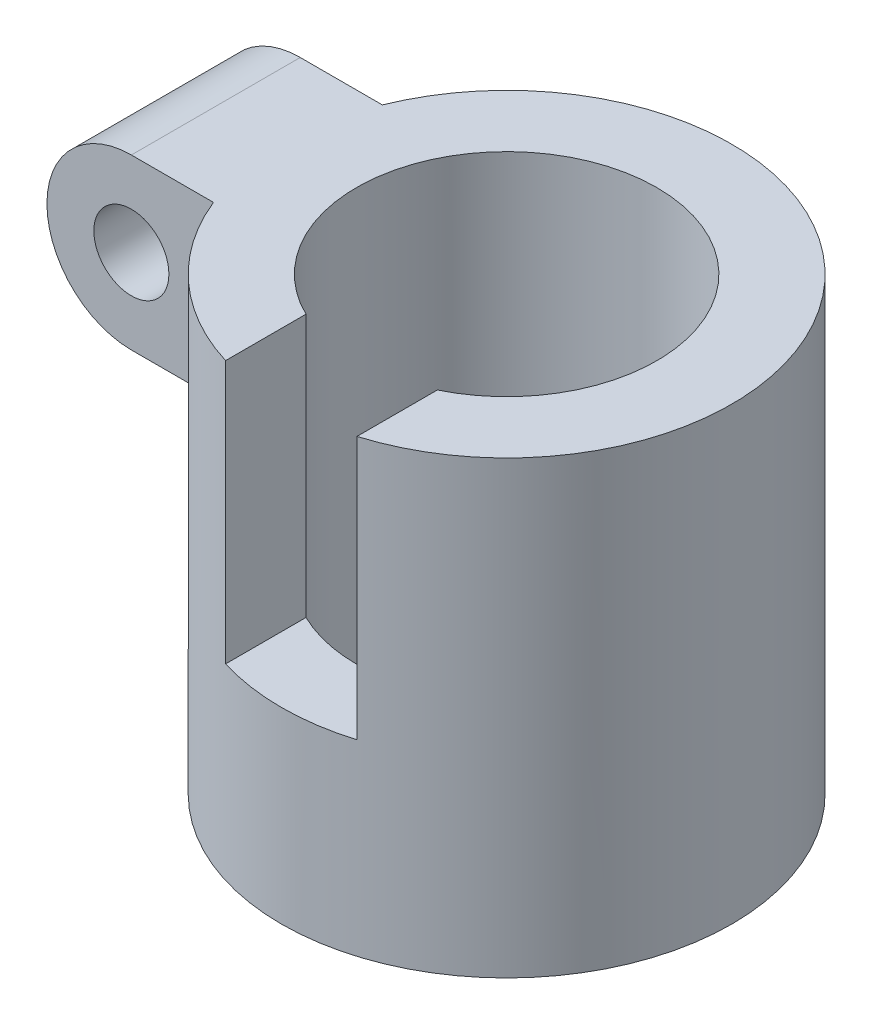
from build123d import *

# Parameters (mm, degrees)
SKETCH_1_R           = 60
SKETCH_1_R_2         = 40
EXTRUDE_1_DEPTH      = 120
EXTRUDE_2_REACH      = 210.806
EXTRUDE_2_END_RADIUS = 60
SKETCH_3_W           = 45
SKETCH_3_H           = 45
FILLET_1_RADIUS      = 22.5
FILLET_1_LENGTH      = 45
SKETCH_4_R           = 10
CUT_EXTRUDE_1_DEPTH  = 177.652908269
SKETCH_5_W           = 35
SKETCH_5_H           = 73.085418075
CUT_EXTRUDE_2_DEPTH  = 70


with BuildPart() as part:
    # Sketch 1 → Extrude 1 (new body)
    with BuildSketch(Plane(origin=(0, 0, 0), x_dir=(1, 0, 0), z_dir=(0, 1, 0))):
        with Locations(Location((0, 0, 0), (0, 0, 270))):
            Circle(SKETCH_1_R)
        with Locations(Location((0, 0, 0), (0, 0, 270))):
            Circle(SKETCH_1_R_2, mode=Mode.SUBTRACT)
    extrude(amount=EXTRUDE_1_DEPTH)

    # Extrude 2: up to this cylinder (the profile starts outside it)
    extrude_2_end = Plane(origin=(0, 97.5, 0), z_dir=(0, -1, 0)) * Cylinder(EXTRUDE_2_END_RADIUS, 542.612, mode=Mode.PRIVATE)
    # Sketch 3 → Extrude 2 (add, up to the surface)
    with BuildSketch(Plane(origin=(-100, 0, 0), x_dir=(0, 0, -1), z_dir=(1, 0, 0)), mode=Mode.PRIVATE) as extrude_2_sk1:
        with Locations((0, 97.5)):
            Rectangle(SKETCH_3_W, SKETCH_3_H)
    extrude_2_tool1 = extrude(extrude_2_sk1.sketch, amount=EXTRUDE_2_REACH, mode=Mode.PRIVATE) - extrude_2_end
    add(extrude_2_tool1.solids().sort_by_distance((-100, 97.5, 0))[0])

    # Fillet 1: full round fillet: the end face becomes a half cylinder, R = half its width
    fillet_1_face = Plane((-100, 97.5, 0), x_dir=(0, 0, 1), z_dir=(-1, 0, 0))  # on the end face: x along it, z out of the body
    fillet_1_slab = fillet_1_face.offset(-FILLET_1_RADIUS / 2) * Box(FILLET_1_LENGTH, 2 * FILLET_1_RADIUS, FILLET_1_RADIUS, mode=Mode.PRIVATE)  # the body's end, R deep
    fillet_1_round = Plane((-77.5, 97.5, 0), x_dir=(-1, 0, 0), z_dir=(0, 0, 1)) * Cylinder(FILLET_1_RADIUS, FILLET_1_LENGTH, mode=Mode.PRIVATE)  # its axis R under the face
    add(fillet_1_slab - fillet_1_round, mode=Mode.SUBTRACT)

    # Sketch 4 → Cut-Extrude 1 (cut, through all)
    with BuildSketch(Plane.XY.offset(22.5)):
        with Locations((-77.5, 97.5)):
            Circle(SKETCH_4_R)
    extrude(amount=-CUT_EXTRUDE_1_DEPTH, mode=Mode.SUBTRACT)

    # Sketch 5 → Cut-Extrude 2 (cut)
    with BuildSketch(Plane(origin=(0, 120, 0), x_dir=(1, 0, 0), z_dir=(0, 1, 0))):
        with Locations((0, -36.542709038)):
            Rectangle(SKETCH_5_W, SKETCH_5_H)
    extrude(amount=-CUT_EXTRUDE_2_DEPTH, mode=Mode.SUBTRACT)


solid = part.part
